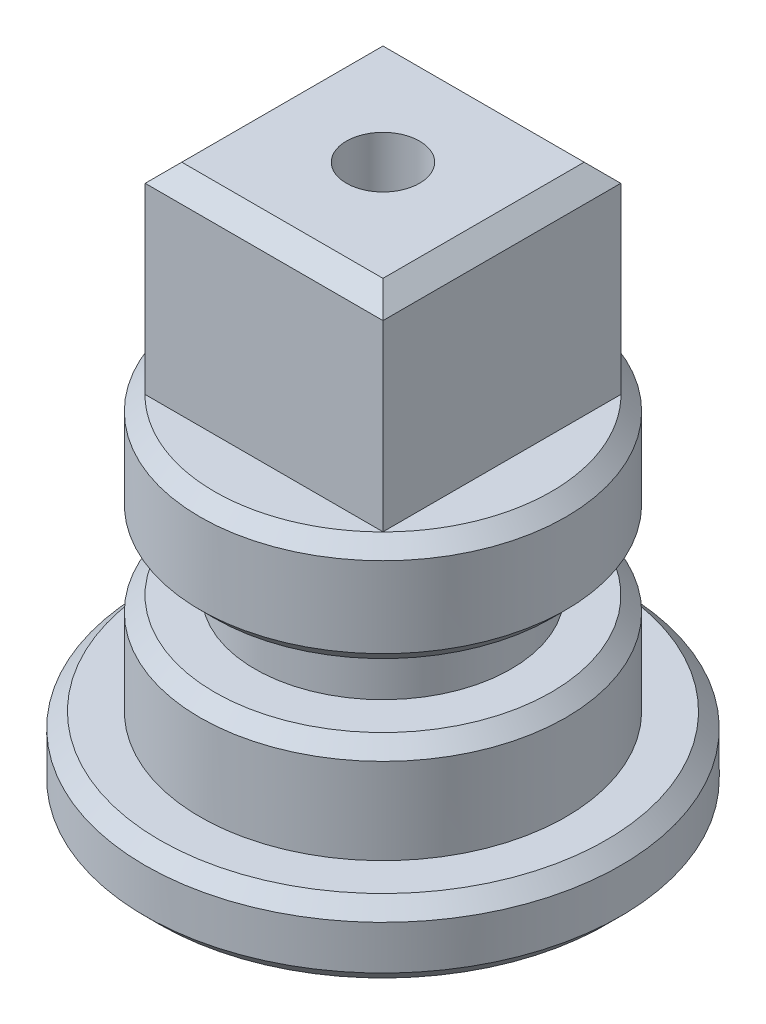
from build123d import *

# Parameters (mm, degrees)
CHANFREIN1_SIZE    = 0.8
ESQUISSE2_W        = 7
ESQUISSE2_H        = 7
BOSS_EXTRU_1_DEPTH = 4
ESQUISSE3_W        = 13
ESQUISSE3_H        = 13
BOSS_EXTRU_2_DEPTH = 11
CHANFREIN2_SIZE    = 1
PER_AGE1_D         = 4
PER_AGE1_DEPTH     = 15
PER_AGE1_TIP       = 1.201721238


with BuildPart() as part:
    # Esquisse1 → Base-R_volution (revolve)
    with BuildSketch(Plane.XY, mode=Mode.PRIVATE) as base_r_volution_sk:
        Polygon((0, 0), (-13, 0), (-13, 4), (-10, 4), (-10, 9.5), (-7, 9.5), (-7, 13), (-10, 13), (-10, 19), (0, 19), align=None)
    revolve(base_r_volution_sk.sketch.rotate(Axis((0, 0, 0), (0, 1, 0)), 270), axis=Axis((0, 0, 0), (0, 1, 0)))

    # Chanfrein1
    chanfrein1_edges = [part.edges().sort_by_distance(p)[0] for p in [
        (0, 0, 13),
        (0, 4, 13),
        (0, 9.5, 10),
        (0, 13, 10),
        (0, 19, 10),
    ]]
    chamfer(chanfrein1_edges, length=CHANFREIN1_SIZE)

    # Esquisse2 → Boss.-Extru.1 (add)
    with BuildSketch(Plane.XZ):
        Rectangle(ESQUISSE2_W, ESQUISSE2_H)
    extrude(amount=BOSS_EXTRU_1_DEPTH)

    # Esquisse3 → Boss.-Extru.2 (add)
    with BuildSketch(Plane(origin=(0, 19, 0), x_dir=(-1, 0, 0), z_dir=(0, 1, 0))):
        Rectangle(ESQUISSE3_W, ESQUISSE3_H)
    extrude(amount=BOSS_EXTRU_2_DEPTH)

    # Chanfrein2
    chanfrein2_edges = [part.edges().sort_by_distance(p)[0] for p in [
        (-6.5, 30, 0),
        (0, 30, 6.5),
        (6.5, 30, 0),
        (0, 30, -6.5),
    ]]
    chamfer(chanfrein2_edges, length=CHANFREIN2_SIZE)

    # Per_age1
    with Locations(Plane(origin=(0, 30, 0), x_dir=(-1, 0, 0), z_dir=(0, 1, 0))):
        with Locations((0, 0)):
            Hole(PER_AGE1_D / 2, depth=PER_AGE1_DEPTH)
            with Locations((0, 0, -(PER_AGE1_DEPTH + PER_AGE1_TIP / 2))):  # 118° drill point
                Cone(0, PER_AGE1_D / 2, PER_AGE1_TIP, mode=Mode.SUBTRACT)


solid = part.part
